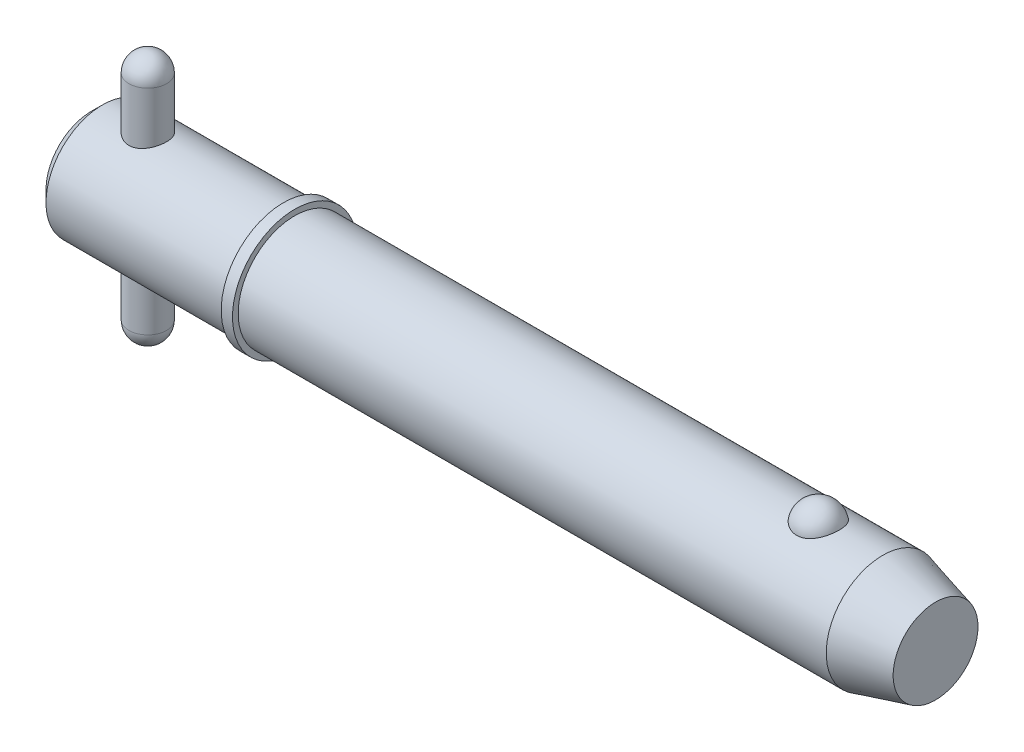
ISO-10303-21;
HEADER;
FILE_DESCRIPTION(('STEP AP214'),'2;1');
FILE_NAME('part.step','',(''),(''),'','','');
FILE_SCHEMA(('AUTOMOTIVE_DESIGN { 1 0 10303 214 1 1 1 1 }'));
ENDSEC;
DATA;
#1=APPLICATION_CONTEXT('core data for automotive mechanical design processes');
#2=APPLICATION_PROTOCOL_DEFINITION('international standard','automotive_design',2000,#1);
#3=PRODUCT_CONTEXT('',#1,'mechanical');
#4=PRODUCT('Part','Part','',(#3));
#5=PRODUCT_RELATED_PRODUCT_CATEGORY('part','',(#4));
#6=PRODUCT_DEFINITION_FORMATION('','',#4);
#7=PRODUCT_DEFINITION_CONTEXT('part definition',#1,'design');
#8=PRODUCT_DEFINITION('design','',#6,#7);
#9=PRODUCT_DEFINITION_SHAPE('','',#8);
#10=(LENGTH_UNIT() NAMED_UNIT(*) SI_UNIT(.MILLI.,.METRE.));
#11=(NAMED_UNIT(*) PLANE_ANGLE_UNIT() SI_UNIT($,.RADIAN.));
#12=(NAMED_UNIT(*) SI_UNIT($,.STERADIAN.) SOLID_ANGLE_UNIT());
#13=UNCERTAINTY_MEASURE_WITH_UNIT(LENGTH_MEASURE(1.E-05),#10,'distance_accuracy_value','');
#14=(GEOMETRIC_REPRESENTATION_CONTEXT(3) GLOBAL_UNCERTAINTY_ASSIGNED_CONTEXT((#13)) GLOBAL_UNIT_ASSIGNED_CONTEXT((#10,
#11,#12)) REPRESENTATION_CONTEXT('',''));
#15=CARTESIAN_POINT('',(0.,0.,0.));
#16=DIRECTION('',(0.,0.,1.));
#17=DIRECTION('',(1.,0.,0.));
#18=AXIS2_PLACEMENT_3D('',#15,#16,#17);
#19=CARTESIAN_POINT('',(7.14,15.875,0.));
#20=DIRECTION('',(0.,-1.,0.));
#21=DIRECTION('',(0.,0.,-1.));
#22=AXIS2_PLACEMENT_3D('',#19,#20,#21);
#23=CYLINDRICAL_SURFACE('',#22,2.38);
#24=CARTESIAN_POINT('',(7.14,-13.495,0.));
#25=DIRECTION('',(0.,-1.,0.));
#26=DIRECTION('',(0.,0.,-1.));
#27=AXIS2_PLACEMENT_3D('',#24,#25,#26);
#28=CIRCLE('',#27,2.38);
#29=CARTESIAN_POINT('',(7.14,-13.495,-2.38));
#30=VERTEX_POINT('',#29);
#31=EDGE_CURVE('P0_E10',#30,#30,#28,.F.);
#32=ORIENTED_EDGE('',*,*,#31,.T.);
#33=EDGE_LOOP('',(#32));
#34=FACE_BOUND('',#33,.T.);
#35=CARTESIAN_POINT('',(7.14,13.495,0.));
#36=DIRECTION('',(0.,-1.,0.));
#37=DIRECTION('',(0.,0.,-1.));
#38=AXIS2_PLACEMENT_3D('',#35,#36,#37);
#39=CIRCLE('',#38,2.38);
#40=CARTESIAN_POINT('',(7.14,13.495,-2.38));
#41=VERTEX_POINT('',#40);
#42=EDGE_CURVE('P0_E21',#41,#41,#39,.T.);
#43=ORIENTED_EDGE('',*,*,#42,.T.);
#44=EDGE_LOOP('',(#43));
#45=FACE_BOUND('',#44,.T.);
#46=ADVANCED_FACE('P0_F14',(#34,#45),#23,.T.);
#47=CARTESIAN_POINT('',(7.14,-13.495,0.));
#48=DIRECTION('',(0.,0.,1.));
#49=DIRECTION('',(1.,0.,0.));
#50=AXIS2_PLACEMENT_3D('',#47,#48,#49);
#51=SPHERICAL_SURFACE('',#50,2.38);
#52=CARTESIAN_POINT('',(7.14,-13.495,0.));
#53=DIRECTION('',(0.,-1.,0.));
#54=DIRECTION('',(0.,0.,-1.));
#55=AXIS2_PLACEMENT_3D('',#52,#53,#54);
#56=SPHERICAL_SURFACE('',#55,2.38);
#57=ORIENTED_EDGE('',*,*,#31,.F.);
#58=EDGE_LOOP('',(#57));
#59=FACE_BOUND('',#58,.T.);
#60=ADVANCED_FACE('P0_F29',(#59),#56,.T.);
#61=CARTESIAN_POINT('',(7.14,13.495,0.));
#62=DIRECTION('',(0.,0.,1.));
#63=DIRECTION('',(1.,0.,0.));
#64=AXIS2_PLACEMENT_3D('',#61,#62,#63);
#65=SPHERICAL_SURFACE('',#64,2.38);
#66=CARTESIAN_POINT('',(7.14,13.495,0.));
#67=DIRECTION('',(0.,-1.,0.));
#68=DIRECTION('',(0.,0.,-1.));
#69=AXIS2_PLACEMENT_3D('',#66,#67,#68);
#70=SPHERICAL_SURFACE('',#69,2.38);
#71=ORIENTED_EDGE('',*,*,#42,.F.);
#72=EDGE_LOOP('',(#71));
#73=FACE_BOUND('',#72,.T.);
#74=ADVANCED_FACE('P0_F16',(#73),#70,.T.);
#75=CLOSED_SHELL('',(#46,#60,#74));
#76=MANIFOLD_SOLID_BREP('P0_B1',#75);
#77=CARTESIAN_POINT('',(0.,0.,0.));
#78=DIRECTION('',(1.,0.,0.));
#79=DIRECTION('',(0.,0.,-1.));
#80=AXIS2_PLACEMENT_3D('',#77,#78,#79);
#81=CYLINDRICAL_SURFACE('',#80,7.145);
#82=CARTESIAN_POINT('',(99.9836242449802,0.,0.));
#83=DIRECTION('',(1.,0.,0.));
#84=DIRECTION('',(0.,0.,-1.));
#85=AXIS2_PLACEMENT_3D('',#82,#83,#84);
#86=CIRCLE('',#85,7.145);
#87=CARTESIAN_POINT('',(99.9836242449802,0.,-7.145));
#88=VERTEX_POINT('',#87);
#89=EDGE_CURVE('P1_E81',#88,#88,#86,.T.);
#90=ORIENTED_EDGE('',*,*,#89,.F.);
#91=EDGE_LOOP('',(#90));
#92=FACE_BOUND('',#91,.T.);
#93=CARTESIAN_POINT('',(25.7,0.,0.));
#94=DIRECTION('',(1.,0.,0.));
#95=DIRECTION('',(0.,0.,-1.));
#96=AXIS2_PLACEMENT_3D('',#93,#94,#95);
#97=CIRCLE('',#96,7.145);
#98=CARTESIAN_POINT('',(25.7,0.,-7.145));
#99=VERTEX_POINT('',#98);
#100=EDGE_CURVE('P1_E85',#99,#99,#97,.T.);
#101=ORIENTED_EDGE('',*,*,#100,.T.);
#102=EDGE_LOOP('',(#101));
#103=FACE_BOUND('',#102,.T.);
#104=CARTESIAN_POINT('',(91.8395037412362,6.60328629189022,2.72903557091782));
#105=CARTESIAN_POINT('',(91.6983158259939,6.60329644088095,2.72902496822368));
#106=CARTESIAN_POINT('',(91.5568832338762,6.60799490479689,2.71772840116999));
#107=CARTESIAN_POINT('',(91.2779557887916,6.62628236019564,2.67281935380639));
#108=CARTESIAN_POINT('',(91.1404726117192,6.63989534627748,2.63914664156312));
#109=CARTESIAN_POINT('',(90.8738894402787,6.67440775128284,2.55059642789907));
#110=CARTESIAN_POINT('',(90.7447683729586,6.69528793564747,2.49577486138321));
#111=CARTESIAN_POINT('',(90.4978694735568,6.74205585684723,2.36651799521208));
#112=CARTESIAN_POINT('',(90.3800865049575,6.76794130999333,2.29209163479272));
#113=CARTESIAN_POINT('',(90.1551671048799,6.82286177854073,2.12312937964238));
#114=CARTESIAN_POINT('',(90.0484405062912,6.85196655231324,2.02807107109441));
#115=CARTESIAN_POINT('',(89.8519181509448,6.90970232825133,1.82167822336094));
#116=CARTESIAN_POINT('',(89.7621276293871,6.93833318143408,1.71033867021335));
#117=CARTESIAN_POINT('',(89.5976670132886,6.9935167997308,1.46891951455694));
#118=CARTESIAN_POINT('',(89.523844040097,7.01992110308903,1.33822781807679));
#119=CARTESIAN_POINT('',(89.3980884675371,7.06643385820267,1.0656656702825));
#120=CARTESIAN_POINT('',(89.3461573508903,7.08654188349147,0.923794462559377));
#121=CARTESIAN_POINT('',(89.2647323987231,7.11862399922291,0.630993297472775));
#122=CARTESIAN_POINT('',(89.2355167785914,7.13049704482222,0.479974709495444));
#123=CARTESIAN_POINT('',(89.2011742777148,7.14449484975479,0.174782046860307));
#124=CARTESIAN_POINT('',(89.1960466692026,7.14661990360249,0.0206080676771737));
#125=CARTESIAN_POINT('',(89.209938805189,7.14092465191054,-0.285506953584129));
#126=CARTESIAN_POINT('',(89.2288101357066,7.1331654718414,-0.437455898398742));
#127=CARTESIAN_POINT('',(89.2900622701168,7.10859076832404,-0.735778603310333));
#128=CARTESIAN_POINT('',(89.3324435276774,7.0917750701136,-0.882152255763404));
#129=CARTESIAN_POINT('',(89.4399346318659,7.05076716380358,-1.16543149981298));
#130=CARTESIAN_POINT('',(89.5050759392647,7.02656475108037,-1.30232366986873));
#131=CARTESIAN_POINT('',(89.6567597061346,6.97329145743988,-1.56265907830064));
#132=CARTESIAN_POINT('',(89.743303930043,6.94422017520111,-1.68610120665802));
#133=CARTESIAN_POINT('',(89.9364654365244,6.88415108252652,-1.91671004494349));
#134=CARTESIAN_POINT('',(90.0431807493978,6.85314438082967,-2.02379244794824));
#135=CARTESIAN_POINT('',(90.2739740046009,6.79282069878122,-2.21787433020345));
#136=CARTESIAN_POINT('',(90.3980505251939,6.76350358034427,-2.30487545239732));
#137=CARTESIAN_POINT('',(90.6576784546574,6.7106058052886,-2.45458647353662));
#138=CARTESIAN_POINT('',(90.7929387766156,6.68691885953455,-2.5177624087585));
#139=CARTESIAN_POINT('',(91.0732778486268,6.64741247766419,-2.62030218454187));
#140=CARTESIAN_POINT('',(91.218352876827,6.63159007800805,-2.65967499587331));
#141=CARTESIAN_POINT('',(91.5063475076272,6.61038594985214,-2.71193301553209));
#142=CARTESIAN_POINT('',(91.6490080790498,6.60451880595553,-2.72605165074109));
#143=CARTESIAN_POINT('',(91.9348004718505,6.60240611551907,-2.73116688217));
#144=CARTESIAN_POINT('',(92.0779321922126,6.60615862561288,-2.72216814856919));
#145=CARTESIAN_POINT('',(92.3558486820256,6.6225609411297,-2.68200435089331));
#146=CARTESIAN_POINT('',(92.4907542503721,6.63492533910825,-2.65154998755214));
#147=CARTESIAN_POINT('',(92.75332009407,6.66687445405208,-2.57015684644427));
#148=CARTESIAN_POINT('',(92.8809797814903,6.68645975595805,-2.51921640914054));
#149=CARTESIAN_POINT('',(93.1285777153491,6.73127274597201,-2.39693610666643));
#150=CARTESIAN_POINT('',(93.2482878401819,6.7566138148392,-2.32517694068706));
#151=CARTESIAN_POINT('',(93.4741592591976,6.8100600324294,-2.1636381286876));
#152=CARTESIAN_POINT('',(93.580317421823,6.83816581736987,-2.07385432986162));
#153=CARTESIAN_POINT('',(93.7818620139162,6.89580469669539,-1.87357235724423));
#154=CARTESIAN_POINT('',(93.876440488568,6.92533863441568,-1.76226074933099));
#155=CARTESIAN_POINT('',(94.0463329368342,6.98139526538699,-1.52511696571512));
#156=CARTESIAN_POINT('',(94.1216434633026,7.0079174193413,-1.39928219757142));
#157=CARTESIAN_POINT('',(94.253595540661,7.05607625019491,-1.1321597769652));
#158=CARTESIAN_POINT('',(94.3095688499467,7.07753119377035,-0.990508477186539));
#159=CARTESIAN_POINT('',(94.3982965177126,7.11222355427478,-0.699154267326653));
#160=CARTESIAN_POINT('',(94.4310506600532,7.12546089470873,-0.549451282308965));
#161=CARTESIAN_POINT('',(94.4726899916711,7.1423758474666,-0.246120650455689));
#162=CARTESIAN_POINT('',(94.481558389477,7.14604673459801,-0.0924903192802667));
#163=CARTESIAN_POINT('',(94.4751940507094,7.14343510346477,0.214181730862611));
#164=CARTESIAN_POINT('',(94.4599618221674,7.13715279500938,0.367223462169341));
#165=CARTESIAN_POINT('',(94.4058451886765,7.11532948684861,0.667595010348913));
#166=CARTESIAN_POINT('',(94.3670776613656,7.09983424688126,0.814949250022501));
#167=CARTESIAN_POINT('',(94.2667700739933,7.06119140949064,1.10063221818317));
#168=CARTESIAN_POINT('',(94.2052284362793,7.03804328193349,1.23896032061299));
#169=CARTESIAN_POINT('',(94.0602071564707,6.98632429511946,1.5035230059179));
#170=CARTESIAN_POINT('',(93.9766067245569,6.95772382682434,1.62968561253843));
#171=CARTESIAN_POINT('',(93.7893804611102,6.89823072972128,1.865543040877));
#172=CARTESIAN_POINT('',(93.6857557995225,6.86733823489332,1.9752388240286));
#173=CARTESIAN_POINT('',(93.4610769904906,6.80676456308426,2.17482293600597));
#174=CARTESIAN_POINT('',(93.3400673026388,6.77708053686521,2.26476035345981));
#175=CARTESIAN_POINT('',(93.0833408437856,6.7223050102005,2.42252989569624));
#176=CARTESIAN_POINT('',(92.94761851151,6.69721525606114,2.49035362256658));
#177=CARTESIAN_POINT('',(92.6704022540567,6.65552591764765,2.59967646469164));
#178=CARTESIAN_POINT('',(92.5292810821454,6.63865794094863,2.64202017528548));
#179=CARTESIAN_POINT('',(92.2414448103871,6.61425039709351,2.70255841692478));
#180=CARTESIAN_POINT('',(92.0947480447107,6.60668259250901,2.720826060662));
#181=CARTESIAN_POINT('',(91.9116799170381,6.60358754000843,2.72830331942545));
#182=CARTESIAN_POINT('',(91.8755998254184,6.60328369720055,2.72903828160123));
#183=CARTESIAN_POINT('',(91.8395037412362,6.60328629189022,2.72903557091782));
#184=B_SPLINE_CURVE_WITH_KNOTS('',3,(#104,#105,#106,#107,#108,#109,#110,#111,#112,#113,#114,
#115,#116,#117,#118,#119,#120,#121,#122,#123,#124,#125,#126,#127,#128,#129,#130,#131,#132,#133,
#134,#135,#136,#137,#138,#139,#140,#141,#142,#143,#144,#145,#146,#147,#148,#149,#150,#151,#152,
#153,#154,#155,#156,#157,#158,#159,#160,#161,#162,#163,#164,#165,#166,#167,#168,#169,#170,#171,
#172,#173,#174,#175,#176,#177,#178,#179,#180,#181,#182,#183),.UNSPECIFIED.,.T.,.F.,(4,2,2,2,2,2,
2,2,2,2,2,2,2,2,2,2,2,2,2,2,2,2,2,2,2,2,2,2,2,2,2,2,2,2,2,2,2,2,2,4),(0.,0.423468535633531,
0.848081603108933,1.27157926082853,1.69488414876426,2.13051395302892,2.56627819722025,
3.0213670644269,3.47648674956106,3.93709649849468,4.39769233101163,4.85545355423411,
5.31322361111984,5.77162895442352,6.23007210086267,6.69080337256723,7.15149693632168,
7.60264329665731,8.05361952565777,8.48189729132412,8.91008854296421,9.32472524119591,
9.73939553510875,10.1630783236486,10.5868588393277,11.0319070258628,11.4770347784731,
11.9362874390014,12.3955443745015,12.855124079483,13.3146940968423,13.7720003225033,
14.2293382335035,14.6892343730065,15.1491036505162,15.6078171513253,16.0667046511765,
16.5093965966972,16.9507410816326,17.059004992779),.UNSPECIFIED.);
#185=CARTESIAN_POINT('',(91.8395037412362,6.60328629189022,2.72903557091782));
#186=VERTEX_POINT('',#185);
#187=EDGE_CURVE('P1_E35',#186,#186,#184,.T.);
#188=ORIENTED_EDGE('',*,*,#187,.T.);
#189=EDGE_LOOP('',(#188));
#190=FACE_BOUND('',#189,.T.);
#191=ADVANCED_FACE('P1_F13',(#92,#103,#190),#81,.T.);
#192=CARTESIAN_POINT('',(0.,0.,0.));
#193=DIRECTION('',(-1.,0.,0.));
#194=DIRECTION('',(0.,0.,1.));
#195=AXIS2_PLACEMENT_3D('',#192,#193,#194);
#196=PLANE('',#195);
#197=CARTESIAN_POINT('',(0.,0.,0.));
#198=DIRECTION('',(1.,0.,0.));
#199=DIRECTION('',(0.,0.,-1.));
#200=AXIS2_PLACEMENT_3D('',#197,#198,#199);
#201=CIRCLE('',#200,5.716);
#202=CARTESIAN_POINT('',(0.,0.,-5.716));
#203=VERTEX_POINT('',#202);
#204=EDGE_CURVE('P1_E9',#203,#203,#201,.T.);
#205=ORIENTED_EDGE('',*,*,#204,.F.);
#206=EDGE_LOOP('',(#205));
#207=FACE_BOUND('',#206,.T.);
#208=ADVANCED_FACE('P1_F15',(#207),#196,.T.);
#209=CARTESIAN_POINT('',(1.42899999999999,0.,0.));
#210=DIRECTION('',(1.,0.,0.));
#211=DIRECTION('',(0.,0.,-1.));
#212=AXIS2_PLACEMENT_3D('',#209,#210,#211);
#213=CONICAL_SURFACE('',#212,7.145,0.78539816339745);
#214=ORIENTED_EDGE('',*,*,#204,.T.);
#215=EDGE_LOOP('',(#214));
#216=FACE_BOUND('',#215,.T.);
#217=CARTESIAN_POINT('',(1.42899999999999,0.,0.));
#218=DIRECTION('',(1.,0.,0.));
#219=DIRECTION('',(0.,0.,-1.));
#220=AXIS2_PLACEMENT_3D('',#217,#218,#219);
#221=CIRCLE('',#220,7.145);
#222=CARTESIAN_POINT('',(1.42899999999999,0.,-7.145));
#223=VERTEX_POINT('',#222);
#224=EDGE_CURVE('P1_E26',#223,#223,#221,.T.);
#225=ORIENTED_EDGE('',*,*,#224,.F.);
#226=EDGE_LOOP('',(#225));
#227=FACE_BOUND('',#226,.T.);
#228=ADVANCED_FACE('P1_F77',(#216,#227),#213,.T.);
#229=CARTESIAN_POINT('',(0.,0.,0.));
#230=DIRECTION('',(1.,0.,0.));
#231=DIRECTION('',(0.,0.,-1.));
#232=AXIS2_PLACEMENT_3D('',#229,#230,#231);
#233=CYLINDRICAL_SURFACE('',#232,7.145);
#234=CARTESIAN_POINT('',(7.14,-6.73695962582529,2.38));
#235=CARTESIAN_POINT('',(7.01035997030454,-6.73695921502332,2.38000059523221));
#236=CARTESIAN_POINT('',(6.88072348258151,-6.74074253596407,2.36937183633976));
#237=CARTESIAN_POINT('',(6.62529075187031,-6.75538853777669,2.32728080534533));
#238=CARTESIAN_POINT('',(6.49949514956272,-6.76625239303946,2.29581507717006));
#239=CARTESIAN_POINT('',(6.2554858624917,-6.79369535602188,2.21327763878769));
#240=CARTESIAN_POINT('',(6.13725786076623,-6.81026326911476,2.16224430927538));
#241=CARTESIAN_POINT('',(5.91100349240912,-6.84723128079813,2.04215132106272));
#242=CARTESIAN_POINT('',(5.80297937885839,-6.86763222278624,1.97308769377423));
#243=CARTESIAN_POINT('',(5.59597854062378,-6.91086152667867,1.81600414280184));
#244=CARTESIAN_POINT('',(5.49745861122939,-6.93375032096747,1.72739874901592));
#245=CARTESIAN_POINT('',(5.31636508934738,-6.97886546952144,1.53499636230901));
#246=CARTESIAN_POINT('',(5.23379405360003,-7.00109171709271,1.43119693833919));
#247=CARTESIAN_POINT('',(5.08487013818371,-7.04307708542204,1.20801318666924));
#248=CARTESIAN_POINT('',(5.01899578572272,-7.06275685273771,1.08829330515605));
#249=CARTESIAN_POINT('',(4.90850130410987,-7.09671988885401,0.838703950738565));
#250=CARTESIAN_POINT('',(4.86387545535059,-7.11100460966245,0.70883722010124));
#251=CARTESIAN_POINT('',(4.79869354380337,-7.13213998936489,0.44742990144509));
#252=CARTESIAN_POINT('',(4.77735497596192,-7.13923172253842,0.316104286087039));
#253=CARTESIAN_POINT('',(4.75686536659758,-7.14603777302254,0.0515578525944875));
#254=CARTESIAN_POINT('',(4.75770861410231,-7.14575398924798,-0.0816624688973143));
#255=CARTESIAN_POINT('',(4.78106216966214,-7.13800438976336,-0.340678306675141));
#256=CARTESIAN_POINT('',(4.80272255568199,-7.13082030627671,-0.466560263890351));
#257=CARTESIAN_POINT('',(4.86569013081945,-7.11043095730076,-0.712788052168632));
#258=CARTESIAN_POINT('',(4.90699865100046,-7.09722528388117,-0.833133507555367));
#259=CARTESIAN_POINT('',(5.00858673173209,-7.06591754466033,-1.06673173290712));
#260=CARTESIAN_POINT('',(5.06910834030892,-7.0477534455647,-1.17987058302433));
#261=CARTESIAN_POINT('',(5.20720514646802,-7.00841977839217,-1.39463797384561));
#262=CARTESIAN_POINT('',(5.28478508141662,-6.987249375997,-1.49626330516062));
#263=CARTESIAN_POINT('',(5.4590800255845,-6.94296010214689,-1.69017445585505));
#264=CARTESIAN_POINT('',(5.55652324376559,-6.91979641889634,-1.78179645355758));
#265=CARTESIAN_POINT('',(5.76558873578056,-6.87497076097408,-1.94761348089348));
#266=CARTESIAN_POINT('',(5.87721318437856,-6.85330901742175,-2.02180583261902));
#267=CARTESIAN_POINT('',(6.11357367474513,-6.81369485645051,-2.15157488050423));
#268=CARTESIAN_POINT('',(6.23847358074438,-6.79579956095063,-2.20687188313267));
#269=CARTESIAN_POINT('',(6.49655785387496,-6.76640630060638,-2.29542443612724));
#270=CARTESIAN_POINT('',(6.62973872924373,-6.75490565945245,-2.32868920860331));
#271=CARTESIAN_POINT('',(6.89417536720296,-6.74020933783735,-2.37088225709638));
#272=CARTESIAN_POINT('',(7.02524746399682,-6.73666278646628,-2.38083959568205));
#273=CARTESIAN_POINT('',(7.28721035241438,-6.73729555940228,-2.37904974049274));
#274=CARTESIAN_POINT('',(7.41810117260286,-6.7414734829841,-2.36730648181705));
#275=CARTESIAN_POINT('',(7.67130717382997,-6.75673471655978,-2.32337336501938));
#276=CARTESIAN_POINT('',(7.79376251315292,-6.76757635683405,-2.29189834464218));
#277=CARTESIAN_POINT('',(8.03162917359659,-6.79467771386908,-2.21025275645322));
#278=CARTESIAN_POINT('',(8.14703924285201,-6.8109383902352,-2.16007887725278));
#279=CARTESIAN_POINT('',(8.37159169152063,-6.84768362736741,-2.04065289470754));
#280=CARTESIAN_POINT('',(8.48041962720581,-6.86828569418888,-1.97084668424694));
#281=CARTESIAN_POINT('',(8.68518919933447,-6.91116416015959,-1.8147657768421));
#282=CARTESIAN_POINT('',(8.78112702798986,-6.93344105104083,-1.72848623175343));
#283=CARTESIAN_POINT('',(8.96215574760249,-6.97845348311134,-1.53698616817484));
#284=CARTESIAN_POINT('',(9.04650427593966,-7.00115965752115,-1.43105491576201));
#285=CARTESIAN_POINT('',(9.19627592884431,-7.04341676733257,-1.20598377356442));
#286=CARTESIAN_POINT('',(9.26169972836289,-7.06296781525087,-1.08684435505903));
#287=CARTESIAN_POINT('',(9.37116617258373,-7.0966205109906,-0.83933303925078));
#288=CARTESIAN_POINT('',(9.41534821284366,-7.11075755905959,-0.711027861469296));
#289=CARTESIAN_POINT('',(9.48132660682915,-7.13214194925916,-0.448245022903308));
#290=CARTESIAN_POINT('',(9.50313102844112,-7.13939177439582,-0.313769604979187));
#291=CARTESIAN_POINT('',(9.5230098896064,-7.14599771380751,-0.049254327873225));
#292=CARTESIAN_POINT('',(9.52215013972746,-7.14570837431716,0.0806974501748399));
#293=CARTESIAN_POINT('',(9.49935359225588,-7.13814116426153,0.338518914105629));
#294=CARTESIAN_POINT('',(9.47741850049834,-7.13086385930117,0.466388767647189));
#295=CARTESIAN_POINT('',(9.4138005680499,-7.11026814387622,0.714400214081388));
#296=CARTESIAN_POINT('',(9.37243609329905,-7.09704726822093,0.834632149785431));
#297=CARTESIAN_POINT('',(9.27142829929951,-7.06592602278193,1.06649582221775));
#298=CARTESIAN_POINT('',(9.2117816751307,-7.04802480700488,1.1781259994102));
#299=CARTESIAN_POINT('',(9.07336776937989,-7.00856499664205,1.39411030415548));
#300=CARTESIAN_POINT('',(8.99397590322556,-6.98689577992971,1.49804368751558));
#301=CARTESIAN_POINT('',(8.81938810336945,-6.9426110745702,1.69146078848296));
#302=CARTESIAN_POINT('',(8.72418713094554,-6.91999528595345,1.78093988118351));
#303=CARTESIAN_POINT('',(8.51623540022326,-6.87531507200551,1.94646188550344));
#304=CARTESIAN_POINT('',(8.4029442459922,-6.85330672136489,2.02184316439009));
#305=CARTESIAN_POINT('',(8.16461714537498,-6.81342065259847,2.1524427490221));
#306=CARTESIAN_POINT('',(8.03958429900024,-6.7955418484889,2.20766635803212));
#307=CARTESIAN_POINT('',(7.78712566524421,-6.76686117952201,2.29403636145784));
#308=CARTESIAN_POINT('',(7.66006989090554,-6.75577342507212,2.32616709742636));
#309=CARTESIAN_POINT('',(7.40200728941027,-6.74082409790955,2.36914495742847));
#310=CARTESIAN_POINT('',(7.27100183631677,-6.73696004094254,2.37999939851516));
#311=CARTESIAN_POINT('',(7.14,-6.73695962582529,2.38));
#312=B_SPLINE_CURVE_WITH_KNOTS('',3,(#234,#235,#236,#237,#238,#239,#240,#241,#242,#243,#244,
#245,#246,#247,#248,#249,#250,#251,#252,#253,#254,#255,#256,#257,#258,#259,#260,#261,#262,#263,
#264,#265,#266,#267,#268,#269,#270,#271,#272,#273,#274,#275,#276,#277,#278,#279,#280,#281,#282,
#283,#284,#285,#286,#287,#288,#289,#290,#291,#292,#293,#294,#295,#296,#297,#298,#299,#300,#301,
#302,#303,#304,#305,#306,#307,#308,#309,#310,#311),.UNSPECIFIED.,.T.,.F.,(4,2,2,2,2,2,2,2,2,2,2,
2,2,2,2,2,2,2,2,2,2,2,2,2,2,2,2,2,2,2,2,2,2,2,2,2,2,2,4),(0.,0.388434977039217,
0.776934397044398,1.16467566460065,1.55250234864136,1.9540847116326,2.35573139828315,
2.76784120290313,3.17984001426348,3.57752248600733,3.97510257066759,4.35711073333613,
4.7391447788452,5.12619663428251,5.51335611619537,5.91871976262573,6.3241456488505,
6.73533623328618,7.14635459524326,7.53885245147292,7.93127914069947,8.31025106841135,
8.68929014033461,9.08033871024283,9.47150254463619,9.88145528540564,10.2913934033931,
10.6986033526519,11.1056664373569,11.4936225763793,11.8815473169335,12.2633262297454,
12.645174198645,13.0411187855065,13.437189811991,13.8487371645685,14.2601761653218,
14.6528265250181,15.0453418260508),.UNSPECIFIED.);
#313=CARTESIAN_POINT('',(7.14,-6.73695962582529,2.38));
#314=VERTEX_POINT('',#313);
#315=EDGE_CURVE('P1_E17',#314,#314,#312,.T.);
#316=ORIENTED_EDGE('',*,*,#315,.F.);
#317=EDGE_LOOP('',(#316));
#318=FACE_BOUND('',#317,.T.);
#319=CARTESIAN_POINT('',(7.14,6.73695962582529,2.38));
#320=CARTESIAN_POINT('',(7.26964002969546,6.73695921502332,2.38000059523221));
#321=CARTESIAN_POINT('',(7.39927651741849,6.74074253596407,2.36937183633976));
#322=CARTESIAN_POINT('',(7.65470924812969,6.75538853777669,2.32728080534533));
#323=CARTESIAN_POINT('',(7.78050485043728,6.76625239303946,2.29581507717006));
#324=CARTESIAN_POINT('',(8.02451413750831,6.79369535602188,2.21327763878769));
#325=CARTESIAN_POINT('',(8.14274213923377,6.81026326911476,2.16224430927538));
#326=CARTESIAN_POINT('',(8.36899650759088,6.84723128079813,2.04215132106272));
#327=CARTESIAN_POINT('',(8.47702062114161,6.86763222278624,1.97308769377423));
#328=CARTESIAN_POINT('',(8.68402145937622,6.91086152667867,1.81600414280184));
#329=CARTESIAN_POINT('',(8.78254138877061,6.93375032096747,1.72739874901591));
#330=CARTESIAN_POINT('',(8.96363491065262,6.97886546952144,1.53499636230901));
#331=CARTESIAN_POINT('',(9.04620594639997,7.00109171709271,1.43119693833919));
#332=CARTESIAN_POINT('',(9.19512986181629,7.04307708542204,1.20801318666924));
#333=CARTESIAN_POINT('',(9.26100421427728,7.06275685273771,1.08829330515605));
#334=CARTESIAN_POINT('',(9.37149869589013,7.09671988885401,0.838703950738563));
#335=CARTESIAN_POINT('',(9.41612454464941,7.11100460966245,0.708837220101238));
#336=CARTESIAN_POINT('',(9.48130645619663,7.13213998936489,0.447429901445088));
#337=CARTESIAN_POINT('',(9.50264502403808,7.13923172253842,0.316104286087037));
#338=CARTESIAN_POINT('',(9.52313463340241,7.14603777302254,0.0515578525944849));
#339=CARTESIAN_POINT('',(9.52229138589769,7.14575398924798,-0.0816624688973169));
#340=CARTESIAN_POINT('',(9.49893783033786,7.13800438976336,-0.340678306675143));
#341=CARTESIAN_POINT('',(9.47727744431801,7.13082030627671,-0.466560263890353));
#342=CARTESIAN_POINT('',(9.41430986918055,7.11043095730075,-0.712788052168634));
#343=CARTESIAN_POINT('',(9.37300134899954,7.09722528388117,-0.833133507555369));
#344=CARTESIAN_POINT('',(9.27141326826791,7.06591754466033,-1.06673173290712));
#345=CARTESIAN_POINT('',(9.21089165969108,7.0477534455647,-1.17987058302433));
#346=CARTESIAN_POINT('',(9.07279485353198,7.00841977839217,-1.39463797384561));
#347=CARTESIAN_POINT('',(8.99521491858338,6.987249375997,-1.49626330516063));
#348=CARTESIAN_POINT('',(8.82091997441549,6.94296010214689,-1.69017445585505));
#349=CARTESIAN_POINT('',(8.72347675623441,6.91979641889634,-1.78179645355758));
#350=CARTESIAN_POINT('',(8.51441126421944,6.87497076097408,-1.94761348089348));
#351=CARTESIAN_POINT('',(8.40278681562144,6.85330901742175,-2.02180583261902));
#352=CARTESIAN_POINT('',(8.16642632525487,6.81369485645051,-2.15157488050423));
#353=CARTESIAN_POINT('',(8.04152641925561,6.79579956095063,-2.20687188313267));
#354=CARTESIAN_POINT('',(7.78344214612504,6.76640630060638,-2.29542443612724));
#355=CARTESIAN_POINT('',(7.65026127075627,6.75490565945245,-2.32868920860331));
#356=CARTESIAN_POINT('',(7.38582463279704,6.74020933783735,-2.37088225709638));
#357=CARTESIAN_POINT('',(7.25475253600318,6.73666278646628,-2.38083959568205));
#358=CARTESIAN_POINT('',(6.99278964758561,6.73729555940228,-2.37904974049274));
#359=CARTESIAN_POINT('',(6.86189882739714,6.7414734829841,-2.36730648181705));
#360=CARTESIAN_POINT('',(6.60869282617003,6.75673471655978,-2.32337336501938));
#361=CARTESIAN_POINT('',(6.48623748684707,6.76757635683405,-2.29189834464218));
#362=CARTESIAN_POINT('',(6.2483708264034,6.79467771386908,-2.21025275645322));
#363=CARTESIAN_POINT('',(6.13296075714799,6.8109383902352,-2.16007887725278));
#364=CARTESIAN_POINT('',(5.90840830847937,6.84768362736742,-2.04065289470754));
#365=CARTESIAN_POINT('',(5.79958037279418,6.86828569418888,-1.97084668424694));
#366=CARTESIAN_POINT('',(5.59481080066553,6.91116416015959,-1.8147657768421));
#367=CARTESIAN_POINT('',(5.49887297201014,6.93344105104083,-1.72848623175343));
#368=CARTESIAN_POINT('',(5.31784425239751,6.97845348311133,-1.53698616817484));
#369=CARTESIAN_POINT('',(5.23349572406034,7.00115965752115,-1.43105491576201));
#370=CARTESIAN_POINT('',(5.08372407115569,7.04341676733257,-1.20598377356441));
#371=CARTESIAN_POINT('',(5.01830027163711,7.06296781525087,-1.08684435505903));
#372=CARTESIAN_POINT('',(4.90883382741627,7.0966205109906,-0.839333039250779));
#373=CARTESIAN_POINT('',(4.86465178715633,7.11075755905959,-0.711027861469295));
#374=CARTESIAN_POINT('',(4.79867339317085,7.13214194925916,-0.448245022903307));
#375=CARTESIAN_POINT('',(4.77686897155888,7.13939177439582,-0.313769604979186));
#376=CARTESIAN_POINT('',(4.7569901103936,7.14599771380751,-0.0492543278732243));
#377=CARTESIAN_POINT('',(4.75784986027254,7.14570837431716,0.0806974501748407));
#378=CARTESIAN_POINT('',(4.78064640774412,7.13814116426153,0.33851891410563));
#379=CARTESIAN_POINT('',(4.80258149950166,7.13086385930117,0.46638876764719));
#380=CARTESIAN_POINT('',(4.8661994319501,7.11026814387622,0.714400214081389));
#381=CARTESIAN_POINT('',(4.90756390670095,7.09704726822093,0.834632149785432));
#382=CARTESIAN_POINT('',(5.00857170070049,7.06592602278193,1.06649582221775));
#383=CARTESIAN_POINT('',(5.0682183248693,7.04802480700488,1.1781259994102));
#384=CARTESIAN_POINT('',(5.20663223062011,7.00856499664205,1.39411030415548));
#385=CARTESIAN_POINT('',(5.28602409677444,6.98689577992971,1.49804368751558));
#386=CARTESIAN_POINT('',(5.46061189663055,6.9426110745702,1.69146078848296));
#387=CARTESIAN_POINT('',(5.55581286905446,6.91999528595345,1.78093988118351));
#388=CARTESIAN_POINT('',(5.76376459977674,6.87531507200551,1.94646188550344));
#389=CARTESIAN_POINT('',(5.8770557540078,6.85330672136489,2.02184316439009));
#390=CARTESIAN_POINT('',(6.11538285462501,6.81342065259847,2.1524427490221));
#391=CARTESIAN_POINT('',(6.24041570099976,6.7955418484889,2.20766635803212));
#392=CARTESIAN_POINT('',(6.4928743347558,6.76686117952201,2.29403636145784));
#393=CARTESIAN_POINT('',(6.61993010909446,6.75577342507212,2.32616709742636));
#394=CARTESIAN_POINT('',(6.87799271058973,6.74082409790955,2.36914495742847));
#395=CARTESIAN_POINT('',(7.00899816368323,6.73696004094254,2.37999939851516));
#396=CARTESIAN_POINT('',(7.14,6.73695962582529,2.38));
#397=B_SPLINE_CURVE_WITH_KNOTS('',3,(#319,#320,#321,#322,#323,#324,#325,#326,#327,#328,#329,
#330,#331,#332,#333,#334,#335,#336,#337,#338,#339,#340,#341,#342,#343,#344,#345,#346,#347,#348,
#349,#350,#351,#352,#353,#354,#355,#356,#357,#358,#359,#360,#361,#362,#363,#364,#365,#366,#367,
#368,#369,#370,#371,#372,#373,#374,#375,#376,#377,#378,#379,#380,#381,#382,#383,#384,#385,#386,
#387,#388,#389,#390,#391,#392,#393,#394,#395,#396),.UNSPECIFIED.,.T.,.F.,(4,2,2,2,2,2,2,2,2,2,2,
2,2,2,2,2,2,2,2,2,2,2,2,2,2,2,2,2,2,2,2,2,2,2,2,2,2,2,4),(0.,0.388434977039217,
0.776934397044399,1.16467566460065,1.55250234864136,1.9540847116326,2.35573139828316,
2.76784120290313,3.17984001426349,3.57752248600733,3.97510257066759,4.35711073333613,
4.73914477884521,5.12619663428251,5.51335611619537,5.91871976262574,6.3241456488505,
6.73533623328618,7.14635459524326,7.53885245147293,7.93127914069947,8.31025106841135,
8.68929014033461,9.08033871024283,9.47150254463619,9.88145528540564,10.2913934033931,
10.6986033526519,11.1056664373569,11.4936225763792,11.8815473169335,12.2633262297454,
12.645174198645,13.0411187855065,13.437189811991,13.8487371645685,14.2601761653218,
14.6528265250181,15.0453418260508),.UNSPECIFIED.);
#398=CARTESIAN_POINT('',(7.14,6.73695962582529,2.38));
#399=VERTEX_POINT('',#398);
#400=EDGE_CURVE('P1_E43',#399,#399,#397,.T.);
#401=ORIENTED_EDGE('',*,*,#400,.F.);
#402=EDGE_LOOP('',(#401));
#403=FACE_BOUND('',#402,.T.);
#404=ORIENTED_EDGE('',*,*,#224,.T.);
#405=EDGE_LOOP('',(#404));
#406=FACE_BOUND('',#405,.T.);
#407=CARTESIAN_POINT('',(24.271,0.,0.));
#408=DIRECTION('',(1.,0.,0.));
#409=DIRECTION('',(0.,0.,-1.));
#410=AXIS2_PLACEMENT_3D('',#407,#408,#409);
#411=CIRCLE('',#410,7.145);
#412=CARTESIAN_POINT('',(24.271,0.,-7.145));
#413=VERTEX_POINT('',#412);
#414=EDGE_CURVE('P1_E31',#413,#413,#411,.T.);
#415=ORIENTED_EDGE('',*,*,#414,.F.);
#416=EDGE_LOOP('',(#415));
#417=FACE_BOUND('',#416,.T.);
#418=ADVANCED_FACE('P1_F103',(#318,#403,#406,#417),#233,.T.);
#419=CARTESIAN_POINT('',(24.271,7.145,0.));
#420=DIRECTION('',(-1.,0.,0.));
#421=DIRECTION('',(0.,0.,1.));
#422=AXIS2_PLACEMENT_3D('',#419,#420,#421);
#423=PLANE('',#422);
#424=ORIENTED_EDGE('',*,*,#414,.T.);
#425=EDGE_LOOP('',(#424));
#426=FACE_BOUND('',#425,.T.);
#427=CARTESIAN_POINT('',(24.271,0.,0.));
#428=DIRECTION('',(1.,0.,0.));
#429=DIRECTION('',(0.,0.,-1.));
#430=AXIS2_PLACEMENT_3D('',#427,#428,#429);
#431=CIRCLE('',#430,7.8595);
#432=CARTESIAN_POINT('',(24.271,0.,-7.8595));
#433=VERTEX_POINT('',#432);
#434=EDGE_CURVE('P1_E91',#433,#433,#431,.T.);
#435=ORIENTED_EDGE('',*,*,#434,.F.);
#436=EDGE_LOOP('',(#435));
#437=FACE_BOUND('',#436,.T.);
#438=ADVANCED_FACE('P1_F100',(#426,#437),#423,.T.);
#439=CARTESIAN_POINT('',(0.,0.,0.));
#440=DIRECTION('',(1.,0.,0.));
#441=DIRECTION('',(0.,0.,-1.));
#442=AXIS2_PLACEMENT_3D('',#439,#440,#441);
#443=CYLINDRICAL_SURFACE('',#442,7.8595);
#444=ORIENTED_EDGE('',*,*,#434,.T.);
#445=EDGE_LOOP('',(#444));
#446=FACE_BOUND('',#445,.T.);
#447=CARTESIAN_POINT('',(25.7,0.,0.));
#448=DIRECTION('',(1.,0.,0.));
#449=DIRECTION('',(0.,0.,-1.));
#450=AXIS2_PLACEMENT_3D('',#447,#448,#449);
#451=CIRCLE('',#450,7.8595);
#452=CARTESIAN_POINT('',(25.7,0.,-7.8595));
#453=VERTEX_POINT('',#452);
#454=EDGE_CURVE('P1_E88',#453,#453,#451,.T.);
#455=ORIENTED_EDGE('',*,*,#454,.F.);
#456=EDGE_LOOP('',(#455));
#457=FACE_BOUND('',#456,.T.);
#458=ADVANCED_FACE('P1_F68',(#446,#457),#443,.T.);
#459=CARTESIAN_POINT('',(25.7,7.8595,0.));
#460=DIRECTION('',(1.,0.,0.));
#461=DIRECTION('',(0.,0.,-1.));
#462=AXIS2_PLACEMENT_3D('',#459,#460,#461);
#463=PLANE('',#462);
#464=ORIENTED_EDGE('',*,*,#454,.T.);
#465=EDGE_LOOP('',(#464));
#466=FACE_BOUND('',#465,.T.);
#467=ORIENTED_EDGE('',*,*,#100,.F.);
#468=EDGE_LOOP('',(#467));
#469=FACE_BOUND('',#468,.T.);
#470=ADVANCED_FACE('P1_F62',(#466,#469),#463,.T.);
#471=CARTESIAN_POINT('',(106.65,0.,0.));
#472=DIRECTION('',(-1.,0.,0.));
#473=DIRECTION('',(0.,0.,1.));
#474=AXIS2_PLACEMENT_3D('',#471,#472,#473);
#475=CONICAL_SURFACE('',#474,5.35875000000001,0.26179938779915);
#476=ORIENTED_EDGE('',*,*,#89,.T.);
#477=EDGE_LOOP('',(#476));
#478=FACE_BOUND('',#477,.T.);
#479=CARTESIAN_POINT('',(106.65,0.,0.));
#480=DIRECTION('',(1.,0.,0.));
#481=DIRECTION('',(0.,0.,-1.));
#482=AXIS2_PLACEMENT_3D('',#479,#480,#481);
#483=CIRCLE('',#482,5.35875000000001);
#484=CARTESIAN_POINT('',(106.65,0.,-5.35875000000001));
#485=VERTEX_POINT('',#484);
#486=EDGE_CURVE('P1_E42',#485,#485,#483,.T.);
#487=ORIENTED_EDGE('',*,*,#486,.F.);
#488=EDGE_LOOP('',(#487));
#489=FACE_BOUND('',#488,.T.);
#490=ADVANCED_FACE('P1_F59',(#478,#489),#475,.T.);
#491=CARTESIAN_POINT('',(106.65,5.35875000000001,0.));
#492=DIRECTION('',(1.,0.,0.));
#493=DIRECTION('',(0.,0.,-1.));
#494=AXIS2_PLACEMENT_3D('',#491,#492,#493);
#495=PLANE('',#494);
#496=ORIENTED_EDGE('',*,*,#486,.T.);
#497=EDGE_LOOP('',(#496));
#498=FACE_BOUND('',#497,.T.);
#499=ADVANCED_FACE('P1_F55',(#498),#495,.T.);
#500=CARTESIAN_POINT('',(91.8395037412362,6.4305,0.));
#501=DIRECTION('',(-1.,0.,0.));
#502=DIRECTION('',(0.,-1.,0.));
#503=AXIS2_PLACEMENT_3D('',#500,#501,#502);
#504=SPHERICAL_SURFACE('',#503,2.73449999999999);
#505=ORIENTED_EDGE('',*,*,#187,.F.);
#506=EDGE_LOOP('',(#505));
#507=FACE_BOUND('',#506,.T.);
#508=ADVANCED_FACE('P1_F50',(#507),#504,.T.);
#509=CARTESIAN_POINT('',(7.14,-7.8595,0.));
#510=DIRECTION('',(0.,1.,0.));
#511=DIRECTION('',(0.,0.,1.));
#512=AXIS2_PLACEMENT_3D('',#509,#510,#511);
#513=CYLINDRICAL_SURFACE('',#512,2.38);
#514=ORIENTED_EDGE('',*,*,#315,.T.);
#515=EDGE_LOOP('',(#514));
#516=FACE_BOUND('',#515,.T.);
#517=ORIENTED_EDGE('',*,*,#400,.T.);
#518=EDGE_LOOP('',(#517));
#519=FACE_BOUND('',#518,.T.);
#520=ADVANCED_FACE('P1_F54',(#516,#519),#513,.F.);
#521=CLOSED_SHELL('',(#191,#208,#228,#418,#438,#458,#470,#490,#499,#508,#520));
#522=MANIFOLD_SOLID_BREP('P1_B1',#521);
#523=ADVANCED_BREP_SHAPE_REPRESENTATION('',(#18,#76,#522),#14);
#524=SHAPE_DEFINITION_REPRESENTATION(#9,#523);
ENDSEC;
END-ISO-10303-21;
